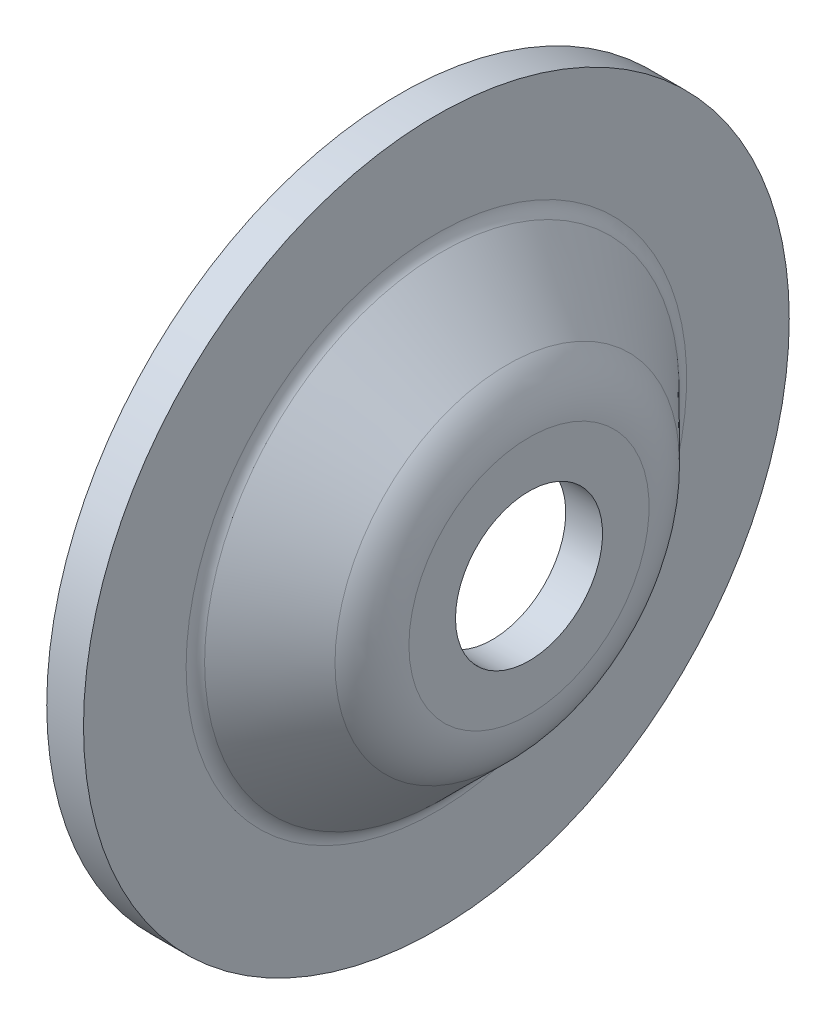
ISO-10303-21;
HEADER;
FILE_DESCRIPTION(('STEP AP214'),'2;1');
FILE_NAME('part.step','',(''),(''),'','','');
FILE_SCHEMA(('AUTOMOTIVE_DESIGN { 1 0 10303 214 1 1 1 1 }'));
ENDSEC;
DATA;
#1=APPLICATION_CONTEXT('core data for automotive mechanical design processes');
#2=APPLICATION_PROTOCOL_DEFINITION('international standard','automotive_design',2000,#1);
#3=PRODUCT_CONTEXT('',#1,'mechanical');
#4=PRODUCT('Part','Part','',(#3));
#5=PRODUCT_RELATED_PRODUCT_CATEGORY('part','',(#4));
#6=PRODUCT_DEFINITION_FORMATION('','',#4);
#7=PRODUCT_DEFINITION_CONTEXT('part definition',#1,'design');
#8=PRODUCT_DEFINITION('design','',#6,#7);
#9=PRODUCT_DEFINITION_SHAPE('','',#8);
#10=(LENGTH_UNIT() NAMED_UNIT(*) SI_UNIT(.MILLI.,.METRE.));
#11=(NAMED_UNIT(*) PLANE_ANGLE_UNIT() SI_UNIT($,.RADIAN.));
#12=(NAMED_UNIT(*) SI_UNIT($,.STERADIAN.) SOLID_ANGLE_UNIT());
#13=UNCERTAINTY_MEASURE_WITH_UNIT(LENGTH_MEASURE(1.E-05),#10,'distance_accuracy_value','');
#14=(GEOMETRIC_REPRESENTATION_CONTEXT(3) GLOBAL_UNCERTAINTY_ASSIGNED_CONTEXT((#13)) GLOBAL_UNIT_ASSIGNED_CONTEXT((#10,
#11,#12)) REPRESENTATION_CONTEXT('',''));
#15=CARTESIAN_POINT('',(0.,0.,0.));
#16=DIRECTION('',(0.,0.,1.));
#17=DIRECTION('',(1.,0.,0.));
#18=AXIS2_PLACEMENT_3D('',#15,#16,#17);
#19=CARTESIAN_POINT('',(-28.,0.,0.));
#20=DIRECTION('',(-1.,0.,0.));
#21=DIRECTION('',(0.,0.,1.));
#22=AXIS2_PLACEMENT_3D('',#19,#20,#21);
#23=CYLINDRICAL_SURFACE('',#22,4.);
#24=CARTESIAN_POINT('',(12.04,0.,0.));
#25=DIRECTION('',(-1.,0.,0.));
#26=DIRECTION('',(0.,0.,1.));
#27=AXIS2_PLACEMENT_3D('',#24,#25,#26);
#28=CIRCLE('',#27,4.);
#29=CARTESIAN_POINT('',(12.04,0.,4.));
#30=VERTEX_POINT('',#29);
#31=EDGE_CURVE('E68',#30,#30,#28,.T.);
#32=ORIENTED_EDGE('',*,*,#31,.F.);
#33=EDGE_LOOP('',(#32));
#34=FACE_BOUND('',#33,.T.);
#35=CARTESIAN_POINT('',(10.04,0.,0.));
#36=DIRECTION('',(-1.,0.,0.));
#37=DIRECTION('',(0.,0.,1.));
#38=AXIS2_PLACEMENT_3D('',#35,#36,#37);
#39=CIRCLE('',#38,4.);
#40=CARTESIAN_POINT('',(10.04,0.,4.));
#41=VERTEX_POINT('',#40);
#42=EDGE_CURVE('E59',#41,#41,#39,.T.);
#43=ORIENTED_EDGE('',*,*,#42,.T.);
#44=EDGE_LOOP('',(#43));
#45=FACE_BOUND('',#44,.T.);
#46=ADVANCED_FACE('F28',(#34,#45),#23,.F.);
#47=CARTESIAN_POINT('',(10.04,7.36690141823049,0.));
#48=DIRECTION('',(1.,0.,0.));
#49=DIRECTION('',(0.,0.,-1.));
#50=AXIS2_PLACEMENT_3D('',#47,#48,#49);
#51=PLANE('',#50);
#52=CARTESIAN_POINT('',(10.04,0.,0.));
#53=DIRECTION('',(1.,0.,0.));
#54=DIRECTION('',(0.,0.,-1.));
#55=AXIS2_PLACEMENT_3D('',#52,#53,#54);
#56=CIRCLE('',#55,6.95035212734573);
#57=CARTESIAN_POINT('',(10.04,0.,-6.95035212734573));
#58=VERTEX_POINT('',#57);
#59=EDGE_CURVE('E34',#58,#58,#56,.F.);
#60=ORIENTED_EDGE('',*,*,#59,.T.);
#61=EDGE_LOOP('',(#60));
#62=FACE_BOUND('',#61,.T.);
#63=ORIENTED_EDGE('',*,*,#42,.F.);
#64=EDGE_LOOP('',(#63));
#65=FACE_BOUND('',#64,.T.);
#66=ADVANCED_FACE('F76',(#62,#65),#51,.F.);
#67=CARTESIAN_POINT('',(5.,0.,0.));
#68=DIRECTION('',(-1.,0.,0.));
#69=DIRECTION('',(0.,0.,1.));
#70=AXIS2_PLACEMENT_3D('',#67,#68,#69);
#71=CONICAL_SURFACE('',#70,12.3669014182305,0.781414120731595);
#72=CARTESIAN_POINT('',(9.74428403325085,0.,0.));
#73=DIRECTION('',(-1.,0.,0.));
#74=DIRECTION('',(0.,0.,1.));
#75=AXIS2_PLACEMENT_3D('',#72,#73,#74);
#76=CIRCLE('',#75,7.66027043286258);
#77=CARTESIAN_POINT('',(9.74428403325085,0.,7.66027043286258));
#78=VERTEX_POINT('',#77);
#79=EDGE_CURVE('E10',#78,#78,#76,.F.);
#80=ORIENTED_EDGE('',*,*,#79,.T.);
#81=EDGE_LOOP('',(#80));
#82=FACE_BOUND('',#81,.T.);
#83=CARTESIAN_POINT('',(6.18286386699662,0.,0.));
#84=DIRECTION('',(1.,0.,0.));
#85=DIRECTION('',(0.,0.,-1.));
#86=AXIS2_PLACEMENT_3D('',#83,#84,#85);
#87=CIRCLE('',#86,11.1934253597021);
#88=CARTESIAN_POINT('',(6.18286386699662,0.,-11.1934253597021));
#89=VERTEX_POINT('',#88);
#90=EDGE_CURVE('E42',#89,#89,#87,.F.);
#91=ORIENTED_EDGE('',*,*,#90,.T.);
#92=EDGE_LOOP('',(#91));
#93=FACE_BOUND('',#92,.T.);
#94=ADVANCED_FACE('F80',(#82,#93),#71,.F.);
#95=CARTESIAN_POINT('',(5.,19.2,0.));
#96=DIRECTION('',(1.,0.,0.));
#97=DIRECTION('',(0.,0.,-1.));
#98=AXIS2_PLACEMENT_3D('',#95,#96,#97);
#99=PLANE('',#98);
#100=CARTESIAN_POINT('',(5.,0.,0.));
#101=DIRECTION('',(1.,0.,0.));
#102=DIRECTION('',(0.,0.,-1.));
#103=AXIS2_PLACEMENT_3D('',#100,#101,#102);
#104=CIRCLE('',#103,14.0330985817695);
#105=CARTESIAN_POINT('',(5.,0.,-14.0330985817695));
#106=VERTEX_POINT('',#105);
#107=EDGE_CURVE('E38',#106,#106,#104,.T.);
#108=ORIENTED_EDGE('',*,*,#107,.T.);
#109=EDGE_LOOP('',(#108));
#110=FACE_BOUND('',#109,.T.);
#111=CARTESIAN_POINT('',(5.,0.,0.));
#112=DIRECTION('',(-1.,0.,0.));
#113=DIRECTION('',(0.,0.,1.));
#114=AXIS2_PLACEMENT_3D('',#111,#112,#113);
#115=CIRCLE('',#114,19.2);
#116=CARTESIAN_POINT('',(5.,0.,19.2));
#117=VERTEX_POINT('',#116);
#118=EDGE_CURVE('E62',#117,#117,#115,.T.);
#119=ORIENTED_EDGE('',*,*,#118,.T.);
#120=EDGE_LOOP('',(#119));
#121=FACE_BOUND('',#120,.T.);
#122=ADVANCED_FACE('F84',(#110,#121),#99,.F.);
#123=CARTESIAN_POINT('',(-28.,0.,0.));
#124=DIRECTION('',(-1.,0.,0.));
#125=DIRECTION('',(0.,0.,1.));
#126=AXIS2_PLACEMENT_3D('',#123,#124,#125);
#127=CYLINDRICAL_SURFACE('',#126,19.2);
#128=ORIENTED_EDGE('',*,*,#118,.F.);
#129=EDGE_LOOP('',(#128));
#130=FACE_BOUND('',#129,.T.);
#131=CARTESIAN_POINT('',(7.,0.,0.));
#132=DIRECTION('',(-1.,0.,0.));
#133=DIRECTION('',(0.,0.,1.));
#134=AXIS2_PLACEMENT_3D('',#131,#132,#133);
#135=CIRCLE('',#134,19.2);
#136=CARTESIAN_POINT('',(7.,0.,19.2));
#137=VERTEX_POINT('',#136);
#138=EDGE_CURVE('E65',#137,#137,#135,.T.);
#139=ORIENTED_EDGE('',*,*,#138,.T.);
#140=EDGE_LOOP('',(#139));
#141=FACE_BOUND('',#140,.T.);
#142=ADVANCED_FACE('F89',(#130,#141),#127,.T.);
#143=CARTESIAN_POINT('',(7.,13.2,0.));
#144=DIRECTION('',(-1.,0.,0.));
#145=DIRECTION('',(0.,0.,1.));
#146=AXIS2_PLACEMENT_3D('',#143,#144,#145);
#147=PLANE('',#146);
#148=CARTESIAN_POINT('',(7.,0.,0.));
#149=DIRECTION('',(-1.,0.,0.));
#150=DIRECTION('',(0.,0.,1.));
#151=AXIS2_PLACEMENT_3D('',#148,#149,#150);
#152=CIRCLE('',#151,13.6165492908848);
#153=CARTESIAN_POINT('',(7.,0.,13.6165492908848));
#154=VERTEX_POINT('',#153);
#155=EDGE_CURVE('E56',#154,#154,#152,.T.);
#156=ORIENTED_EDGE('',*,*,#155,.T.);
#157=EDGE_LOOP('',(#156));
#158=FACE_BOUND('',#157,.T.);
#159=ORIENTED_EDGE('',*,*,#138,.F.);
#160=EDGE_LOOP('',(#159));
#161=FACE_BOUND('',#160,.T.);
#162=ADVANCED_FACE('F93',(#158,#161),#147,.F.);
#163=CARTESIAN_POINT('',(12.04,0.,0.));
#164=DIRECTION('',(-1.,0.,0.));
#165=DIRECTION('',(0.,0.,1.));
#166=AXIS2_PLACEMENT_3D('',#163,#164,#165);
#167=CONICAL_SURFACE('',#166,8.2,0.781414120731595);
#168=CARTESIAN_POINT('',(10.8571361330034,0.,0.));
#169=DIRECTION('',(1.,0.,0.));
#170=DIRECTION('',(0.,0.,-1.));
#171=AXIS2_PLACEMENT_3D('',#168,#169,#170);
#172=CIRCLE('',#171,9.37347605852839);
#173=CARTESIAN_POINT('',(10.8571361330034,0.,-9.37347605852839));
#174=VERTEX_POINT('',#173);
#175=EDGE_CURVE('E50',#174,#174,#172,.F.);
#176=ORIENTED_EDGE('',*,*,#175,.T.);
#177=EDGE_LOOP('',(#176));
#178=FACE_BOUND('',#177,.T.);
#179=CARTESIAN_POINT('',(7.29571596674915,0.,0.));
#180=DIRECTION('',(-1.,0.,0.));
#181=DIRECTION('',(0.,0.,1.));
#182=AXIS2_PLACEMENT_3D('',#179,#180,#181);
#183=CIRCLE('',#182,12.9066309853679);
#184=CARTESIAN_POINT('',(7.29571596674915,0.,12.9066309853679));
#185=VERTEX_POINT('',#184);
#186=EDGE_CURVE('E53',#185,#185,#183,.F.);
#187=ORIENTED_EDGE('',*,*,#186,.T.);
#188=EDGE_LOOP('',(#187));
#189=FACE_BOUND('',#188,.T.);
#190=ADVANCED_FACE('F97',(#178,#189),#167,.T.);
#191=CARTESIAN_POINT('',(12.04,4.,0.));
#192=DIRECTION('',(-1.,0.,0.));
#193=DIRECTION('',(0.,0.,1.));
#194=AXIS2_PLACEMENT_3D('',#191,#192,#193);
#195=PLANE('',#194);
#196=CARTESIAN_POINT('',(12.04,0.,0.));
#197=DIRECTION('',(-1.,0.,0.));
#198=DIRECTION('',(0.,0.,1.));
#199=AXIS2_PLACEMENT_3D('',#196,#197,#198);
#200=CIRCLE('',#199,6.53380283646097);
#201=CARTESIAN_POINT('',(12.04,0.,6.53380283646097));
#202=VERTEX_POINT('',#201);
#203=EDGE_CURVE('E47',#202,#202,#200,.F.);
#204=ORIENTED_EDGE('',*,*,#203,.T.);
#205=EDGE_LOOP('',(#204));
#206=FACE_BOUND('',#205,.T.);
#207=ORIENTED_EDGE('',*,*,#31,.T.);
#208=EDGE_LOOP('',(#207));
#209=FACE_BOUND('',#208,.T.);
#210=ADVANCED_FACE('F72',(#206,#209),#195,.F.);
#211=CARTESIAN_POINT('',(8.,0.,0.));
#212=DIRECTION('',(-1.,0.,0.));
#213=DIRECTION('',(0.,0.,1.));
#214=AXIS2_PLACEMENT_3D('',#211,#212,#213);
#215=TOROIDAL_SURFACE('',#214,13.6165492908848,1.);
#216=ORIENTED_EDGE('',*,*,#186,.F.);
#217=EDGE_LOOP('',(#216));
#218=FACE_BOUND('',#217,.T.);
#219=ORIENTED_EDGE('',*,*,#155,.F.);
#220=EDGE_LOOP('',(#219));
#221=FACE_BOUND('',#220,.T.);
#222=ADVANCED_FACE('F104',(#218,#221),#215,.F.);
#223=CARTESIAN_POINT('',(8.04,0.,0.));
#224=DIRECTION('',(-1.,0.,0.));
#225=DIRECTION('',(0.,0.,1.));
#226=AXIS2_PLACEMENT_3D('',#223,#224,#225);
#227=TOROIDAL_SURFACE('',#226,6.53380283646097,4.);
#228=ORIENTED_EDGE('',*,*,#203,.F.);
#229=EDGE_LOOP('',(#228));
#230=FACE_BOUND('',#229,.T.);
#231=ORIENTED_EDGE('',*,*,#175,.F.);
#232=EDGE_LOOP('',(#231));
#233=FACE_BOUND('',#232,.T.);
#234=ADVANCED_FACE('F108',(#230,#233),#227,.T.);
#235=CARTESIAN_POINT('',(9.,0.,0.));
#236=DIRECTION('',(1.,0.,0.));
#237=DIRECTION('',(0.,0.,-1.));
#238=AXIS2_PLACEMENT_3D('',#235,#236,#237);
#239=TOROIDAL_SURFACE('',#238,14.0330985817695,4.);
#240=ORIENTED_EDGE('',*,*,#107,.F.);
#241=EDGE_LOOP('',(#240));
#242=FACE_BOUND('',#241,.T.);
#243=ORIENTED_EDGE('',*,*,#90,.F.);
#244=EDGE_LOOP('',(#243));
#245=FACE_BOUND('',#244,.T.);
#246=ADVANCED_FACE('F112',(#242,#245),#239,.T.);
#247=CARTESIAN_POINT('',(9.04,0.,0.));
#248=DIRECTION('',(1.,0.,0.));
#249=DIRECTION('',(0.,0.,-1.));
#250=AXIS2_PLACEMENT_3D('',#247,#248,#249);
#251=TOROIDAL_SURFACE('',#250,6.95035212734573,1.);
#252=ORIENTED_EDGE('',*,*,#79,.F.);
#253=EDGE_LOOP('',(#252));
#254=FACE_BOUND('',#253,.T.);
#255=ORIENTED_EDGE('',*,*,#59,.F.);
#256=EDGE_LOOP('',(#255));
#257=FACE_BOUND('',#256,.T.);
#258=ADVANCED_FACE('F116',(#254,#257),#251,.F.);
#259=CLOSED_SHELL('',(#46,#66,#94,#122,#142,#162,#190,#210,#222,#234,#246,#258));
#260=MANIFOLD_SOLID_BREP('B2',#259);
#261=ADVANCED_BREP_SHAPE_REPRESENTATION('',(#18,#260),#14);
#262=SHAPE_DEFINITION_REPRESENTATION(#9,#261);
ENDSEC;
END-ISO-10303-21;
